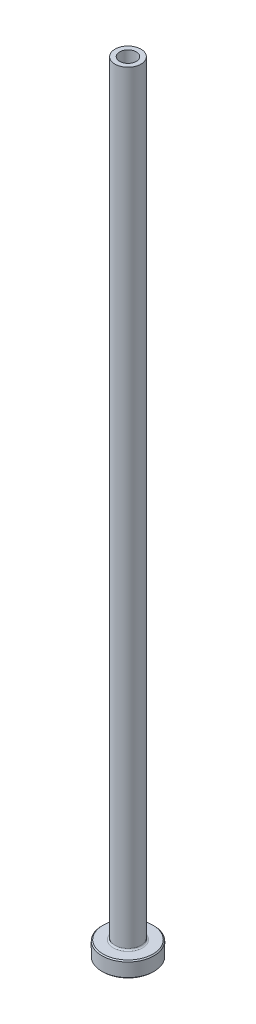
ISO-10303-21;
HEADER;
FILE_DESCRIPTION(('STEP AP214'),'2;1');
FILE_NAME('part.step','',(''),(''),'','','');
FILE_SCHEMA(('AUTOMOTIVE_DESIGN { 1 0 10303 214 1 1 1 1 }'));
ENDSEC;
DATA;
#1=APPLICATION_CONTEXT('core data for automotive mechanical design processes');
#2=APPLICATION_PROTOCOL_DEFINITION('international standard','automotive_design',2000,#1);
#3=PRODUCT_CONTEXT('',#1,'mechanical');
#4=PRODUCT('Part','Part','',(#3));
#5=PRODUCT_RELATED_PRODUCT_CATEGORY('part','',(#4));
#6=PRODUCT_DEFINITION_FORMATION('','',#4);
#7=PRODUCT_DEFINITION_CONTEXT('part definition',#1,'design');
#8=PRODUCT_DEFINITION('design','',#6,#7);
#9=PRODUCT_DEFINITION_SHAPE('','',#8);
#10=(LENGTH_UNIT() NAMED_UNIT(*) SI_UNIT(.MILLI.,.METRE.));
#11=(NAMED_UNIT(*) PLANE_ANGLE_UNIT() SI_UNIT($,.RADIAN.));
#12=(NAMED_UNIT(*) SI_UNIT($,.STERADIAN.) SOLID_ANGLE_UNIT());
#13=UNCERTAINTY_MEASURE_WITH_UNIT(LENGTH_MEASURE(1.E-05),#10,'distance_accuracy_value','');
#14=(GEOMETRIC_REPRESENTATION_CONTEXT(3) GLOBAL_UNCERTAINTY_ASSIGNED_CONTEXT((#13)) GLOBAL_UNIT_ASSIGNED_CONTEXT((#10,
#11,#12)) REPRESENTATION_CONTEXT('',''));
#15=CARTESIAN_POINT('',(0.,0.,0.));
#16=DIRECTION('',(0.,0.,1.));
#17=DIRECTION('',(1.,0.,0.));
#18=AXIS2_PLACEMENT_3D('',#15,#16,#17);
#19=CARTESIAN_POINT('',(0.,92.1876809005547,0.));
#20=DIRECTION('',(0.,1.,0.));
#21=DIRECTION('',(0.,0.,1.));
#22=AXIS2_PLACEMENT_3D('',#19,#20,#21);
#23=CYLINDRICAL_SURFACE('',#22,1.6);
#24=CARTESIAN_POINT('',(0.,150.,0.));
#25=DIRECTION('',(0.,1.,0.));
#26=DIRECTION('',(0.,0.,1.));
#27=AXIS2_PLACEMENT_3D('',#24,#25,#26);
#28=CIRCLE('',#27,1.6);
#29=CARTESIAN_POINT('',(0.,150.,1.6));
#30=VERTEX_POINT('',#29);
#31=EDGE_CURVE('E62',#30,#30,#28,.T.);
#32=ORIENTED_EDGE('',*,*,#31,.T.);
#33=EDGE_LOOP('',(#32));
#34=FACE_BOUND('',#33,.T.);
#35=CARTESIAN_POINT('',(0.,105.,0.));
#36=DIRECTION('',(0.,1.,0.));
#37=DIRECTION('',(0.,0.,1.));
#38=AXIS2_PLACEMENT_3D('',#35,#36,#37);
#39=CIRCLE('',#38,1.6);
#40=CARTESIAN_POINT('',(0.,105.,1.6));
#41=VERTEX_POINT('',#40);
#42=EDGE_CURVE('E71',#41,#41,#39,.T.);
#43=ORIENTED_EDGE('',*,*,#42,.F.);
#44=EDGE_LOOP('',(#43));
#45=FACE_BOUND('',#44,.T.);
#46=ADVANCED_FACE('F30',(#34,#45),#23,.F.);
#47=CARTESIAN_POINT('',(-1.6,150.,0.));
#48=DIRECTION('',(0.,1.,0.));
#49=DIRECTION('',(0.,0.,1.));
#50=AXIS2_PLACEMENT_3D('',#47,#48,#49);
#51=PLANE('',#50);
#52=CARTESIAN_POINT('',(0.,150.,0.));
#53=DIRECTION('',(0.,1.,0.));
#54=DIRECTION('',(0.,0.,1.));
#55=AXIS2_PLACEMENT_3D('',#52,#53,#54);
#56=CIRCLE('',#55,2.50000000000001);
#57=CARTESIAN_POINT('',(0.,150.,2.50000000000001));
#58=VERTEX_POINT('',#57);
#59=EDGE_CURVE('E65',#58,#58,#56,.T.);
#60=ORIENTED_EDGE('',*,*,#59,.T.);
#61=EDGE_LOOP('',(#60));
#62=FACE_BOUND('',#61,.T.);
#63=ORIENTED_EDGE('',*,*,#31,.F.);
#64=EDGE_LOOP('',(#63));
#65=FACE_BOUND('',#64,.T.);
#66=ADVANCED_FACE('F79',(#62,#65),#51,.T.);
#67=CARTESIAN_POINT('',(0.,92.1876809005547,0.));
#68=DIRECTION('',(0.,1.,0.));
#69=DIRECTION('',(0.,0.,1.));
#70=AXIS2_PLACEMENT_3D('',#67,#68,#69);
#71=CYLINDRICAL_SURFACE('',#70,2.5);
#72=CARTESIAN_POINT('',(0.,3.3,0.));
#73=DIRECTION('',(0.,1.,0.));
#74=DIRECTION('',(0.,0.,1.));
#75=AXIS2_PLACEMENT_3D('',#72,#73,#74);
#76=CIRCLE('',#75,2.5);
#77=CARTESIAN_POINT('',(0.,3.3,2.5));
#78=VERTEX_POINT('',#77);
#79=EDGE_CURVE('E59',#78,#78,#76,.T.);
#80=ORIENTED_EDGE('',*,*,#79,.T.);
#81=EDGE_LOOP('',(#80));
#82=FACE_BOUND('',#81,.T.);
#83=ORIENTED_EDGE('',*,*,#59,.F.);
#84=EDGE_LOOP('',(#83));
#85=FACE_BOUND('',#84,.T.);
#86=ADVANCED_FACE('F85',(#82,#85),#71,.T.);
#87=CARTESIAN_POINT('',(-2.49999999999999,3.,0.));
#88=DIRECTION('',(0.,1.,0.));
#89=DIRECTION('',(0.,0.,1.));
#90=AXIS2_PLACEMENT_3D('',#87,#88,#89);
#91=PLANE('',#90);
#92=CARTESIAN_POINT('',(0.,3.,0.));
#93=DIRECTION('',(0.,1.,0.));
#94=DIRECTION('',(0.,0.,1.));
#95=AXIS2_PLACEMENT_3D('',#92,#93,#94);
#96=CIRCLE('',#95,4.79999999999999);
#97=CARTESIAN_POINT('',(0.,3.,4.79999999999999));
#98=VERTEX_POINT('',#97);
#99=EDGE_CURVE('E53',#98,#98,#96,.T.);
#100=ORIENTED_EDGE('',*,*,#99,.T.);
#101=EDGE_LOOP('',(#100));
#102=FACE_BOUND('',#101,.T.);
#103=CARTESIAN_POINT('',(0.,3.,0.));
#104=DIRECTION('',(0.,1.,0.));
#105=DIRECTION('',(0.,0.,1.));
#106=AXIS2_PLACEMENT_3D('',#103,#104,#105);
#107=CIRCLE('',#106,2.8);
#108=CARTESIAN_POINT('',(0.,3.,2.8));
#109=VERTEX_POINT('',#108);
#110=EDGE_CURVE('E56',#109,#109,#107,.F.);
#111=ORIENTED_EDGE('',*,*,#110,.T.);
#112=EDGE_LOOP('',(#111));
#113=FACE_BOUND('',#112,.T.);
#114=ADVANCED_FACE('F111',(#102,#113),#91,.T.);
#115=CARTESIAN_POINT('',(0.,92.1876809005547,0.));
#116=DIRECTION('',(0.,1.,0.));
#117=DIRECTION('',(0.,0.,1.));
#118=AXIS2_PLACEMENT_3D('',#115,#116,#117);
#119=CYLINDRICAL_SURFACE('',#118,4.99999999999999);
#120=CARTESIAN_POINT('',(0.,2.8,0.));
#121=DIRECTION('',(0.,1.,0.));
#122=DIRECTION('',(0.,0.,1.));
#123=AXIS2_PLACEMENT_3D('',#120,#121,#122);
#124=CIRCLE('',#123,4.99999999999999);
#125=CARTESIAN_POINT('',(0.,2.8,4.99999999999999));
#126=VERTEX_POINT('',#125);
#127=EDGE_CURVE('E45',#126,#126,#124,.F.);
#128=ORIENTED_EDGE('',*,*,#127,.T.);
#129=EDGE_LOOP('',(#128));
#130=FACE_BOUND('',#129,.T.);
#131=CARTESIAN_POINT('',(0.,0.199999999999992,0.));
#132=DIRECTION('',(0.,-1.,0.));
#133=DIRECTION('',(0.,0.,-1.));
#134=AXIS2_PLACEMENT_3D('',#131,#132,#133);
#135=CIRCLE('',#134,4.99999999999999);
#136=CARTESIAN_POINT('',(0.,0.199999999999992,-4.99999999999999));
#137=VERTEX_POINT('',#136);
#138=EDGE_CURVE('E50',#137,#137,#135,.F.);
#139=ORIENTED_EDGE('',*,*,#138,.T.);
#140=EDGE_LOOP('',(#139));
#141=FACE_BOUND('',#140,.T.);
#142=ADVANCED_FACE('F108',(#130,#141),#119,.T.);
#143=CARTESIAN_POINT('',(-4.99999999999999,0.,0.));
#144=DIRECTION('',(0.,-1.,0.));
#145=DIRECTION('',(0.,0.,-1.));
#146=AXIS2_PLACEMENT_3D('',#143,#144,#145);
#147=PLANE('',#146);
#148=CARTESIAN_POINT('',(0.,0.,0.));
#149=DIRECTION('',(0.,-1.,0.));
#150=DIRECTION('',(0.,0.,-1.));
#151=AXIS2_PLACEMENT_3D('',#148,#149,#150);
#152=CIRCLE('',#151,2.34999999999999);
#153=CARTESIAN_POINT('',(0.,0.,-2.34999999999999));
#154=VERTEX_POINT('',#153);
#155=EDGE_CURVE('E37',#154,#154,#152,.F.);
#156=ORIENTED_EDGE('',*,*,#155,.T.);
#157=EDGE_LOOP('',(#156));
#158=FACE_BOUND('',#157,.T.);
#159=CARTESIAN_POINT('',(0.,0.,0.));
#160=DIRECTION('',(0.,-1.,0.));
#161=DIRECTION('',(0.,0.,-1.));
#162=AXIS2_PLACEMENT_3D('',#159,#160,#161);
#163=CIRCLE('',#162,4.8);
#164=CARTESIAN_POINT('',(0.,0.,-4.8));
#165=VERTEX_POINT('',#164);
#166=EDGE_CURVE('E41',#165,#165,#163,.T.);
#167=ORIENTED_EDGE('',*,*,#166,.T.);
#168=EDGE_LOOP('',(#167));
#169=FACE_BOUND('',#168,.T.);
#170=ADVANCED_FACE('F110',(#158,#169),#147,.T.);
#171=CARTESIAN_POINT('',(0.,92.1876809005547,0.));
#172=DIRECTION('',(0.,1.,0.));
#173=DIRECTION('',(0.,0.,1.));
#174=AXIS2_PLACEMENT_3D('',#171,#172,#173);
#175=CYLINDRICAL_SURFACE('',#174,1.85);
#176=CARTESIAN_POINT('',(0.,0.499999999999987,0.));
#177=DIRECTION('',(0.,-1.,0.));
#178=DIRECTION('',(0.,0.,-1.));
#179=AXIS2_PLACEMENT_3D('',#176,#177,#178);
#180=CIRCLE('',#179,1.85);
#181=CARTESIAN_POINT('',(0.,0.499999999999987,-1.85));
#182=VERTEX_POINT('',#181);
#183=EDGE_CURVE('E10',#182,#182,#180,.T.);
#184=ORIENTED_EDGE('',*,*,#183,.T.);
#185=EDGE_LOOP('',(#184));
#186=FACE_BOUND('',#185,.T.);
#187=CARTESIAN_POINT('',(0.,93.,0.));
#188=DIRECTION('',(0.,1.,0.));
#189=DIRECTION('',(0.,0.,1.));
#190=AXIS2_PLACEMENT_3D('',#187,#188,#189);
#191=CIRCLE('',#190,1.85);
#192=CARTESIAN_POINT('',(0.,93.,1.85));
#193=VERTEX_POINT('',#192);
#194=EDGE_CURVE('E68',#193,#193,#191,.T.);
#195=ORIENTED_EDGE('',*,*,#194,.T.);
#196=EDGE_LOOP('',(#195));
#197=FACE_BOUND('',#196,.T.);
#198=ADVANCED_FACE('F118',(#186,#197),#175,.F.);
#199=CARTESIAN_POINT('',(0.,93.,0.));
#200=DIRECTION('',(0.,-1.,0.));
#201=DIRECTION('',(0.,0.,-1.));
#202=AXIS2_PLACEMENT_3D('',#199,#200,#201);
#203=CONICAL_SURFACE('',#202,1.85,0.0208303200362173);
#204=ORIENTED_EDGE('',*,*,#42,.T.);
#205=EDGE_LOOP('',(#204));
#206=FACE_BOUND('',#205,.T.);
#207=ORIENTED_EDGE('',*,*,#194,.F.);
#208=EDGE_LOOP('',(#207));
#209=FACE_BOUND('',#208,.T.);
#210=ADVANCED_FACE('F75',(#206,#209),#203,.F.);
#211=CARTESIAN_POINT('',(0.,3.3,0.));
#212=DIRECTION('',(0.,1.,0.));
#213=DIRECTION('',(0.,0.,1.));
#214=AXIS2_PLACEMENT_3D('',#211,#212,#213);
#215=TOROIDAL_SURFACE('',#214,2.8,0.3);
#216=ORIENTED_EDGE('',*,*,#110,.F.);
#217=EDGE_LOOP('',(#216));
#218=FACE_BOUND('',#217,.T.);
#219=ORIENTED_EDGE('',*,*,#79,.F.);
#220=EDGE_LOOP('',(#219));
#221=FACE_BOUND('',#220,.T.);
#222=ADVANCED_FACE('F90',(#218,#221),#215,.F.);
#223=CARTESIAN_POINT('',(0.,3.,0.));
#224=DIRECTION('',(0.,-1.,0.));
#225=DIRECTION('',(0.,0.,-1.));
#226=AXIS2_PLACEMENT_3D('',#223,#224,#225);
#227=CONICAL_SURFACE('',#226,4.79999999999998,0.785398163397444);
#228=ORIENTED_EDGE('',*,*,#127,.F.);
#229=EDGE_LOOP('',(#228));
#230=FACE_BOUND('',#229,.T.);
#231=ORIENTED_EDGE('',*,*,#99,.F.);
#232=EDGE_LOOP('',(#231));
#233=FACE_BOUND('',#232,.T.);
#234=ADVANCED_FACE('F93',(#230,#233),#227,.T.);
#235=CARTESIAN_POINT('',(0.,0.199999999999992,0.));
#236=DIRECTION('',(0.,1.,0.));
#237=DIRECTION('',(0.,0.,1.));
#238=AXIS2_PLACEMENT_3D('',#235,#236,#237);
#239=CONICAL_SURFACE('',#238,4.99999999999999,0.785398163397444);
#240=ORIENTED_EDGE('',*,*,#166,.F.);
#241=EDGE_LOOP('',(#240));
#242=FACE_BOUND('',#241,.T.);
#243=ORIENTED_EDGE('',*,*,#138,.F.);
#244=EDGE_LOOP('',(#243));
#245=FACE_BOUND('',#244,.T.);
#246=ADVANCED_FACE('F96',(#242,#245),#239,.T.);
#247=CARTESIAN_POINT('',(0.,0.,0.));
#248=DIRECTION('',(0.,-1.,0.));
#249=DIRECTION('',(0.,0.,-1.));
#250=AXIS2_PLACEMENT_3D('',#247,#248,#249);
#251=CONICAL_SURFACE('',#250,2.34999999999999,0.785398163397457);
#252=ORIENTED_EDGE('',*,*,#183,.F.);
#253=EDGE_LOOP('',(#252));
#254=FACE_BOUND('',#253,.T.);
#255=ORIENTED_EDGE('',*,*,#155,.F.);
#256=EDGE_LOOP('',(#255));
#257=FACE_BOUND('',#256,.T.);
#258=ADVANCED_FACE('F32',(#254,#257),#251,.F.);
#259=CLOSED_SHELL('',(#46,#66,#86,#114,#142,#170,#198,#210,#222,#234,#246,#258));
#260=MANIFOLD_SOLID_BREP('B2',#259);
#261=ADVANCED_BREP_SHAPE_REPRESENTATION('',(#18,#260),#14);
#262=SHAPE_DEFINITION_REPRESENTATION(#9,#261);
ENDSEC;
END-ISO-10303-21;
